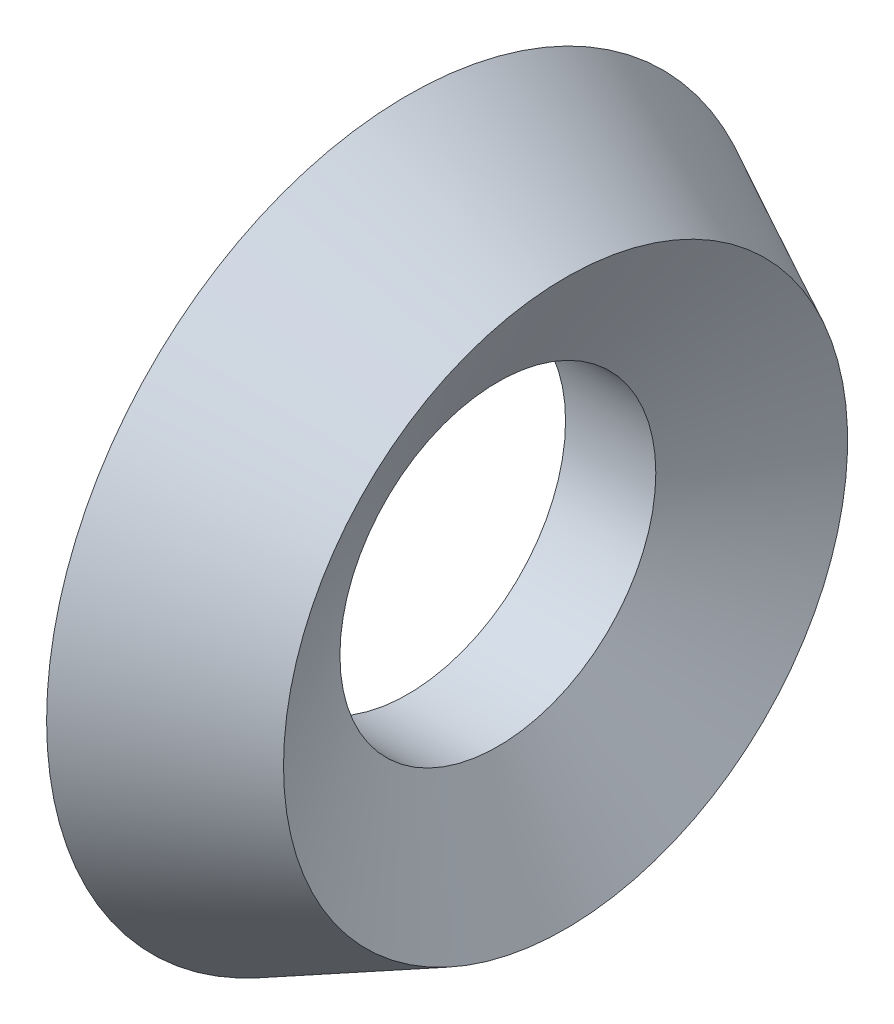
ISO-10303-21;
HEADER;
FILE_DESCRIPTION(('STEP AP214'),'2;1');
FILE_NAME('part.step','',(''),(''),'','','');
FILE_SCHEMA(('AUTOMOTIVE_DESIGN { 1 0 10303 214 1 1 1 1 }'));
ENDSEC;
DATA;
#1=APPLICATION_CONTEXT('core data for automotive mechanical design processes');
#2=APPLICATION_PROTOCOL_DEFINITION('international standard','automotive_design',2000,#1);
#3=PRODUCT_CONTEXT('',#1,'mechanical');
#4=PRODUCT('Part','Part','',(#3));
#5=PRODUCT_RELATED_PRODUCT_CATEGORY('part','',(#4));
#6=PRODUCT_DEFINITION_FORMATION('','',#4);
#7=PRODUCT_DEFINITION_CONTEXT('part definition',#1,'design');
#8=PRODUCT_DEFINITION('design','',#6,#7);
#9=PRODUCT_DEFINITION_SHAPE('','',#8);
#10=(LENGTH_UNIT() NAMED_UNIT(*) SI_UNIT(.MILLI.,.METRE.));
#11=(NAMED_UNIT(*) PLANE_ANGLE_UNIT() SI_UNIT($,.RADIAN.));
#12=(NAMED_UNIT(*) SI_UNIT($,.STERADIAN.) SOLID_ANGLE_UNIT());
#13=UNCERTAINTY_MEASURE_WITH_UNIT(LENGTH_MEASURE(1.E-05),#10,'distance_accuracy_value','');
#14=(GEOMETRIC_REPRESENTATION_CONTEXT(3) GLOBAL_UNCERTAINTY_ASSIGNED_CONTEXT((#13)) GLOBAL_UNIT_ASSIGNED_CONTEXT((#10,
#11,#12)) REPRESENTATION_CONTEXT('',''));
#15=CARTESIAN_POINT('',(0.,0.,0.));
#16=DIRECTION('',(0.,0.,1.));
#17=DIRECTION('',(1.,0.,0.));
#18=AXIS2_PLACEMENT_3D('',#15,#16,#17);
#19=CARTESIAN_POINT('',(-10.,0.,0.));
#20=DIRECTION('',(-1.,0.,0.));
#21=DIRECTION('',(0.,0.,1.));
#22=AXIS2_PLACEMENT_3D('',#19,#20,#21);
#23=CYLINDRICAL_SURFACE('',#22,3.5);
#24=CARTESIAN_POINT('',(2.,0.,0.));
#25=DIRECTION('',(-1.,0.,0.));
#26=DIRECTION('',(0.,0.,1.));
#27=AXIS2_PLACEMENT_3D('',#24,#25,#26);
#28=CIRCLE('',#27,3.5);
#29=CARTESIAN_POINT('',(2.,0.,3.5));
#30=VERTEX_POINT('',#29);
#31=EDGE_CURVE('E43',#30,#30,#28,.T.);
#32=ORIENTED_EDGE('',*,*,#31,.F.);
#33=EDGE_LOOP('',(#32));
#34=FACE_BOUND('',#33,.T.);
#35=CARTESIAN_POINT('',(0.,0.,0.));
#36=DIRECTION('',(-1.,0.,0.));
#37=DIRECTION('',(0.,0.,1.));
#38=AXIS2_PLACEMENT_3D('',#35,#36,#37);
#39=CIRCLE('',#38,3.5);
#40=CARTESIAN_POINT('',(0.,0.,3.5));
#41=VERTEX_POINT('',#40);
#42=EDGE_CURVE('E10',#41,#41,#39,.T.);
#43=ORIENTED_EDGE('',*,*,#42,.T.);
#44=EDGE_LOOP('',(#43));
#45=FACE_BOUND('',#44,.T.);
#46=ADVANCED_FACE('F29',(#34,#45),#23,.F.);
#47=CARTESIAN_POINT('',(0.,3.5,0.));
#48=DIRECTION('',(1.,0.,0.));
#49=DIRECTION('',(0.,0.,-1.));
#50=AXIS2_PLACEMENT_3D('',#47,#48,#49);
#51=PLANE('',#50);
#52=ORIENTED_EDGE('',*,*,#42,.F.);
#53=EDGE_LOOP('',(#52));
#54=FACE_BOUND('',#53,.T.);
#55=CARTESIAN_POINT('',(0.,0.,0.));
#56=DIRECTION('',(-1.,0.,0.));
#57=DIRECTION('',(0.,0.,1.));
#58=AXIS2_PLACEMENT_3D('',#55,#56,#57);
#59=CIRCLE('',#58,8.);
#60=CARTESIAN_POINT('',(0.,0.,8.));
#61=VERTEX_POINT('',#60);
#62=EDGE_CURVE('E35',#61,#61,#59,.T.);
#63=ORIENTED_EDGE('',*,*,#62,.T.);
#64=EDGE_LOOP('',(#63));
#65=FACE_BOUND('',#64,.T.);
#66=ADVANCED_FACE('F52',(#54,#65),#51,.F.);
#67=CARTESIAN_POINT('',(3.5,0.,0.));
#68=DIRECTION('',(-1.,0.,0.));
#69=DIRECTION('',(0.,0.,1.));
#70=AXIS2_PLACEMENT_3D('',#67,#68,#69);
#71=CONICAL_SURFACE('',#70,6.25,0.463647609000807);
#72=ORIENTED_EDGE('',*,*,#62,.F.);
#73=EDGE_LOOP('',(#72));
#74=FACE_BOUND('',#73,.T.);
#75=CARTESIAN_POINT('',(3.5,0.,0.));
#76=DIRECTION('',(-1.,0.,0.));
#77=DIRECTION('',(0.,0.,1.));
#78=AXIS2_PLACEMENT_3D('',#75,#76,#77);
#79=CIRCLE('',#78,6.25);
#80=CARTESIAN_POINT('',(3.5,0.,6.25));
#81=VERTEX_POINT('',#80);
#82=EDGE_CURVE('E39',#81,#81,#79,.T.);
#83=ORIENTED_EDGE('',*,*,#82,.T.);
#84=EDGE_LOOP('',(#83));
#85=FACE_BOUND('',#84,.T.);
#86=ADVANCED_FACE('F56',(#74,#85),#71,.T.);
#87=CARTESIAN_POINT('',(2.,0.,0.));
#88=DIRECTION('',(1.,0.,0.));
#89=DIRECTION('',(0.,0.,-1.));
#90=AXIS2_PLACEMENT_3D('',#87,#88,#89);
#91=CONICAL_SURFACE('',#90,3.5,1.07144960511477);
#92=ORIENTED_EDGE('',*,*,#82,.F.);
#93=EDGE_LOOP('',(#92));
#94=FACE_BOUND('',#93,.T.);
#95=ORIENTED_EDGE('',*,*,#31,.T.);
#96=EDGE_LOOP('',(#95));
#97=FACE_BOUND('',#96,.T.);
#98=ADVANCED_FACE('F49',(#94,#97),#91,.F.);
#99=CLOSED_SHELL('',(#46,#66,#86,#98));
#100=MANIFOLD_SOLID_BREP('B2',#99);
#101=ADVANCED_BREP_SHAPE_REPRESENTATION('',(#18,#100),#14);
#102=SHAPE_DEFINITION_REPRESENTATION(#9,#101);
ENDSEC;
END-ISO-10303-21;
